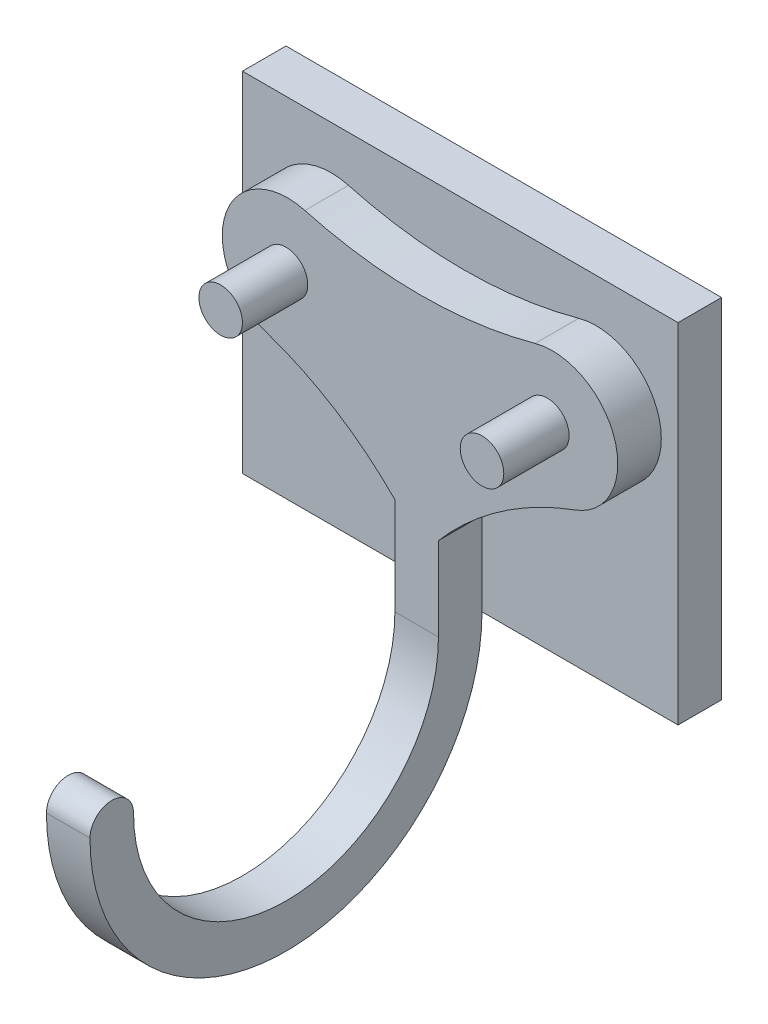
from build123d import *

# Parameters (mm, degrees)
CROQUIS1_W              = 20
CROQUIS1_H              = 16
SALIENTE_EXTRUIR1_DEPTH = 2
SALIENTE_EXTRUIR2_DEPTH = 2
SALIENTE_EXTRUIR3_DEPTH = 1
CROQUIS6_R              = 1
SALIENTE_EXTRUIR4_DEPTH = 3


with BuildPart() as part:
    # Croquis1 → Saliente-Extruir1 (new body)
    with BuildSketch(Plane.XY):
        Rectangle(CROQUIS1_W, CROQUIS1_H)
    extrude(amount=SALIENTE_EXTRUIR1_DEPTH)

    # Croquis2 → Saliente-Extruir2 (add)
    with BuildSketch(Plane.XY.offset(2)):
        with BuildLine():
            Line((-1, -3.538748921), (-1, -8))
            Line((-1, -8), (1, -8))
            Line((1, -8), (1, -4.166392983))
            ThreePointArc((1, -4.166392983), (3.849977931, -1.587798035), (7.261659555, 0.181934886))
            ThreePointArc((7.261659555, 0.181934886), (9.090946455, 3.911656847), (5.439899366, 5.893315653))
            ThreePointArc((5.439899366, 5.893315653), (0.153755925, 5.182086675), (-5.132387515, 5.893315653))
            ThreePointArc((-5.132387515, 5.893315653), (-8.79383401, 3.878387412), (-6.888389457, 0.158789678))
            ThreePointArc((-6.888389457, 0.158789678), (-3.726994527, -1.344084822), (-1, -3.538748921))
        make_face()
    extrude(amount=SALIENTE_EXTRUIR2_DEPTH)

    # Croquis5 → Saliente-Extruir3 (add, symmetric)
    with BuildSketch(Plane(origin=(0, 0, 0), x_dir=(0, 0, -1), z_dir=(1, 0, 0))):
        with BuildLine():
            Line((-4, -8), (-2, -8))
            ThreePointArc((-2, -8), (-11, -17), (-20, -8))
            ThreePointArc((-20, -8), (-19, -7), (-18, -8))
            ThreePointArc((-18, -8), (-11, -15), (-4, -8))
        make_face()
    extrude(amount=SALIENTE_EXTRUIR3_DEPTH, both=True)

    # Croquis6 → Saliente-Extruir4 (add)
    with BuildSketch(Plane.XY.offset(4)):
        with Locations(Location((-6, 3, 0), (0, 0, 180))):
            Circle(CROQUIS6_R)
        with Locations(Location((6, 3, 0), (0, 0, 180))):
            Circle(CROQUIS6_R)
    extrude(amount=SALIENTE_EXTRUIR4_DEPTH)


solid = part.part
